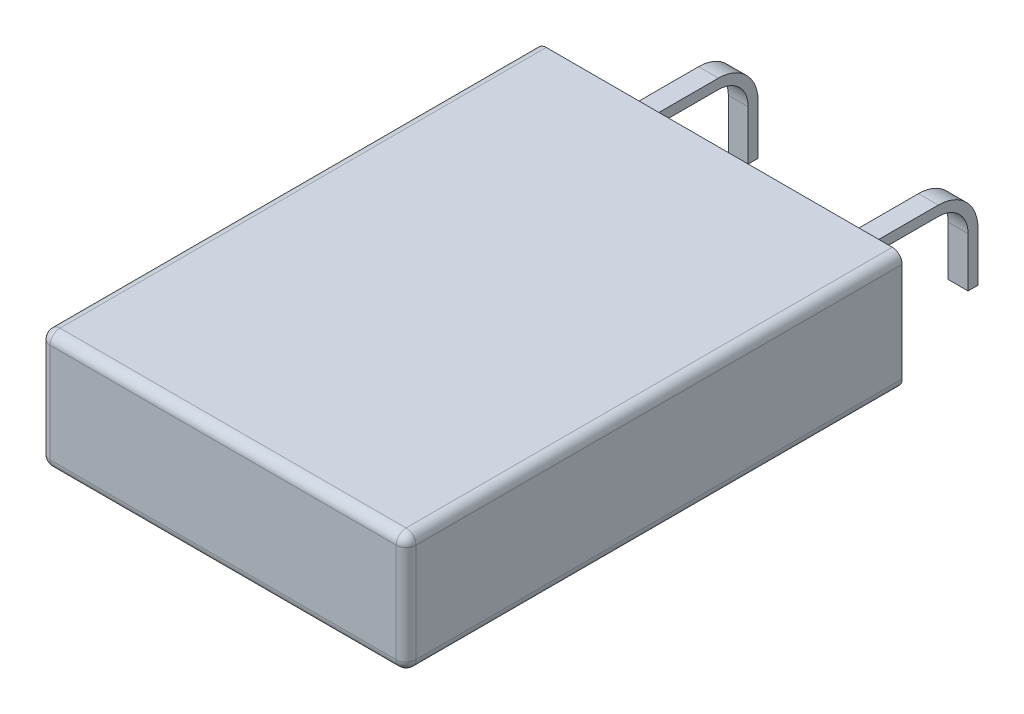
from build123d import *

# Parameters (mm, degrees)
EXTRUDE1_DEPTH     = 25
FILLET1_R          = 0.5
SKETCH3_W          = 16.44
SKETCH3_H          = 4
CUT_EXTRUDE1_DEPTH = 5
PROFILE_W          = 1
PROFILE_H          = 0.5


with BuildPart() as part:
    # Sketch2 → Extrude1 (new body)
    with BuildSketch(Plane.XY):
        with BuildLine():
            Line((0.5, 0), (17.94, 0))
            ThreePointArc((17.94, 0), (18.293553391, 0.146446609), (18.44, 0.5))
            Line((18.44, 0.5), (18.44, 5.5))
            ThreePointArc((18.44, 5.5), (18.293553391, 5.853553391), (17.94, 6))
            Line((17.94, 6), (0.5, 6))
            ThreePointArc((0.5, 6), (0.146446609, 5.853553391), (0, 5.5))
            Line((0, 5.5), (0, 0.5))
            ThreePointArc((0, 0.5), (0.146446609, 0.146446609), (0.5, 0))
        make_face()
    extrude(amount=-EXTRUDE1_DEPTH)

    # Fillet1
    fillet1_edges = [part.edges().sort_by_distance(p)[0] for p in [
        (9.22, 6, 0),
        (18.293553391, 5.853553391, 0),
        (18.44, 3, 0),
        (18.293553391, 0.146446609, 0),
        (9.22, 0, 0),
        (0.146446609, 0.146446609, 0),
        (0, 3, 0),
        (0.146446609, 5.853553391, 0),
    ]]
    fillet(fillet1_edges, radius=FILLET1_R)

    # Sketch3 → Cut-Extrude1 (cut)
    with BuildSketch(Plane(origin=(0, 0, -25), x_dir=(-1, 0, 0), z_dir=(0, 0, -1))):
        with Locations((-9.22, 3)):
            Rectangle(SKETCH3_W, SKETCH3_H)
    extrude(amount=-CUT_EXTRUDE1_DEPTH, mode=Mode.SUBTRACT)

    # Sweep1: sweep along a path in Path
    with BuildLine(Plane(origin=(9.22, 0, 0), x_dir=(0, 0, -1), z_dir=(1, 0, 0))) as sweep1_path:
        Line((20, 3.5), (30, 3.5))
        ThreePointArc((30, 3.5), (31.060660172, 3.060660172), (31.5, 2))
        Line((31.5, 2), (31.5, -0.5))
    # Profile → Sweep1 (sweep)
    with BuildSketch(Plane(origin=(0, 0, -20), x_dir=(-1, 0, 0), z_dir=(0, 0, -1))):
        with Locations((-14.76, 3.75)):
            Rectangle(PROFILE_W, PROFILE_H)
        with Locations((-3.68, 3.75)):
            Rectangle(PROFILE_W, PROFILE_H)
    sweep(path=sweep1_path.line)


solid = part.part
